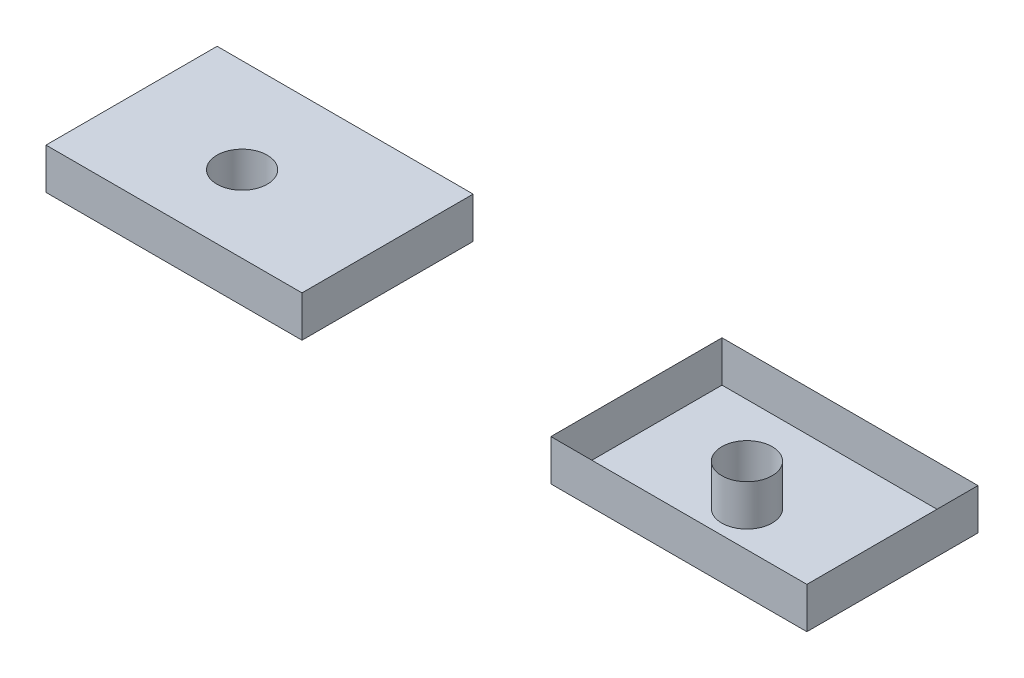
ISO-10303-21;
HEADER;
FILE_DESCRIPTION(('STEP AP214'),'2;1');
FILE_NAME('part.step','',(''),(''),'','','');
FILE_SCHEMA(('AUTOMOTIVE_DESIGN { 1 0 10303 214 1 1 1 1 }'));
ENDSEC;
DATA;
#1=APPLICATION_CONTEXT('core data for automotive mechanical design processes');
#2=APPLICATION_PROTOCOL_DEFINITION('international standard','automotive_design',2000,#1);
#3=PRODUCT_CONTEXT('',#1,'mechanical');
#4=PRODUCT('Part','Part','',(#3));
#5=PRODUCT_RELATED_PRODUCT_CATEGORY('part','',(#4));
#6=PRODUCT_DEFINITION_FORMATION('','',#4);
#7=PRODUCT_DEFINITION_CONTEXT('part definition',#1,'design');
#8=PRODUCT_DEFINITION('design','',#6,#7);
#9=PRODUCT_DEFINITION_SHAPE('','',#8);
#10=(LENGTH_UNIT() NAMED_UNIT(*) SI_UNIT(.MILLI.,.METRE.));
#11=(NAMED_UNIT(*) PLANE_ANGLE_UNIT() SI_UNIT($,.RADIAN.));
#12=(NAMED_UNIT(*) SI_UNIT($,.STERADIAN.) SOLID_ANGLE_UNIT());
#13=UNCERTAINTY_MEASURE_WITH_UNIT(LENGTH_MEASURE(1.E-05),#10,'distance_accuracy_value','');
#14=(GEOMETRIC_REPRESENTATION_CONTEXT(3) GLOBAL_UNCERTAINTY_ASSIGNED_CONTEXT((#13)) GLOBAL_UNIT_ASSIGNED_CONTEXT((#10,
#11,#12)) REPRESENTATION_CONTEXT('',''));
#15=CARTESIAN_POINT('',(0.,0.,0.));
#16=DIRECTION('',(0.,0.,1.));
#17=DIRECTION('',(1.,0.,0.));
#18=AXIS2_PLACEMENT_3D('',#15,#16,#17);
#19=CARTESIAN_POINT('',(490.265330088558,0.,-38.835495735));
#20=DIRECTION('',(0.,1.,0.));
#21=DIRECTION('',(0.,0.,1.));
#22=AXIS2_PLACEMENT_3D('',#19,#20,#21);
#23=CYLINDRICAL_SURFACE('',#22,12.7580583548);
#24=CARTESIAN_POINT('',(490.265330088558,20.7672057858,-38.835495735));
#25=DIRECTION('',(0.,1.,0.));
#26=DIRECTION('',(0.,0.,1.));
#27=AXIS2_PLACEMENT_3D('',#24,#25,#26);
#28=CIRCLE('',#27,12.7580583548);
#29=CARTESIAN_POINT('',(490.265330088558,20.7672057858,-26.0774373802));
#30=VERTEX_POINT('',#29);
#31=EDGE_CURVE('E12',#30,#30,#28,.T.);
#32=ORIENTED_EDGE('',*,*,#31,.F.);
#33=EDGE_LOOP('',(#32));
#34=FACE_BOUND('',#33,.T.);
#35=CARTESIAN_POINT('',(490.265330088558,0.,-38.835495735));
#36=DIRECTION('',(0.,1.,0.));
#37=DIRECTION('',(0.,0.,1.));
#38=AXIS2_PLACEMENT_3D('',#35,#36,#37);
#39=CIRCLE('',#38,12.7580583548);
#40=CARTESIAN_POINT('',(490.265330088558,0.,-26.0774373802));
#41=VERTEX_POINT('',#40);
#42=EDGE_CURVE('E51',#41,#41,#39,.F.);
#43=ORIENTED_EDGE('',*,*,#42,.F.);
#44=EDGE_LOOP('',(#43));
#45=FACE_BOUND('',#44,.T.);
#46=ADVANCED_FACE('F48',(#34,#45),#23,.T.);
#47=CARTESIAN_POINT('',(429.841584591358,0.,0.));
#48=DIRECTION('',(0.,-1.,0.));
#49=DIRECTION('',(0.,0.,-1.));
#50=AXIS2_PLACEMENT_3D('',#47,#48,#49);
#51=PLANE('',#50);
#52=ORIENTED_EDGE('',*,*,#42,.T.);
#53=EDGE_LOOP('',(#52));
#54=FACE_BOUND('',#53,.T.);
#55=DIRECTION('',(0.,0.,1.));
#56=VECTOR('',#55,1.);
#57=CARTESIAN_POINT('',(559.431427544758,0.,-43.3127745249));
#58=LINE('',#57,#56);
#59=CARTESIAN_POINT('',(559.431427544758,0.,-86.6255490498));
#60=VERTEX_POINT('',#59);
#61=CARTESIAN_POINT('',(559.431427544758,0.,0.));
#62=VERTEX_POINT('',#61);
#63=EDGE_CURVE('E64',#60,#62,#58,.T.);
#64=ORIENTED_EDGE('',*,*,#63,.F.);
#65=DIRECTION('',(1.,0.,0.));
#66=VECTOR('',#65,1.);
#67=CARTESIAN_POINT('',(494.636506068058,0.,-86.6255490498));
#68=LINE('',#67,#66);
#69=CARTESIAN_POINT('',(429.841584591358,0.,-86.6255490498));
#70=VERTEX_POINT('',#69);
#71=EDGE_CURVE('E123',#70,#60,#68,.T.);
#72=ORIENTED_EDGE('',*,*,#71,.F.);
#73=DIRECTION('',(0.,0.,-1.));
#74=VECTOR('',#73,1.);
#75=CARTESIAN_POINT('',(429.841584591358,0.,-43.3127745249));
#76=LINE('',#75,#74);
#77=CARTESIAN_POINT('',(429.841584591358,0.,0.));
#78=VERTEX_POINT('',#77);
#79=EDGE_CURVE('E94',#78,#70,#76,.T.);
#80=ORIENTED_EDGE('',*,*,#79,.F.);
#81=DIRECTION('',(-1.,0.,0.));
#82=VECTOR('',#81,1.);
#83=CARTESIAN_POINT('',(494.636506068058,0.,0.));
#84=LINE('',#83,#82);
#85=EDGE_CURVE('E120',#62,#78,#84,.T.);
#86=ORIENTED_EDGE('',*,*,#85,.F.);
#87=EDGE_LOOP('',(#64,#72,#80,#86));
#88=FACE_BOUND('',#87,.T.);
#89=ADVANCED_FACE('F128',(#54,#88),#51,.F.);
#90=CARTESIAN_POINT('',(559.431427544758,0.,0.));
#91=DIRECTION('',(0.,0.,-1.));
#92=DIRECTION('',(-1.,0.,0.));
#93=AXIS2_PLACEMENT_3D('',#90,#91,#92);
#94=PLANE('',#93);
#95=DIRECTION('',(0.,-1.,0.));
#96=VECTOR('',#95,1.);
#97=CARTESIAN_POINT('',(559.431427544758,10.3836028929,0.));
#98=LINE('',#97,#96);
#99=CARTESIAN_POINT('',(559.431427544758,20.7672057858,0.));
#100=VERTEX_POINT('',#99);
#101=EDGE_CURVE('E81',#100,#62,#98,.T.);
#102=ORIENTED_EDGE('',*,*,#101,.T.);
#103=ORIENTED_EDGE('',*,*,#85,.T.);
#104=DIRECTION('',(0.,1.,0.));
#105=VECTOR('',#104,1.);
#106=CARTESIAN_POINT('',(429.841584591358,10.3836028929,0.));
#107=LINE('',#106,#105);
#108=CARTESIAN_POINT('',(429.841584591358,20.7672057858,0.));
#109=VERTEX_POINT('',#108);
#110=EDGE_CURVE('E78',#78,#109,#107,.T.);
#111=ORIENTED_EDGE('',*,*,#110,.T.);
#112=DIRECTION('',(1.,0.,0.));
#113=VECTOR('',#112,1.);
#114=CARTESIAN_POINT('',(494.636506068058,20.7672057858,0.));
#115=LINE('',#114,#113);
#116=EDGE_CURVE('E115',#109,#100,#115,.T.);
#117=ORIENTED_EDGE('',*,*,#116,.T.);
#118=EDGE_LOOP('',(#102,#103,#111,#117));
#119=FACE_BOUND('',#118,.T.);
#120=ADVANCED_FACE('F130',(#119),#94,.T.);
#121=CARTESIAN_POINT('',(559.431427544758,0.,-86.6255490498));
#122=DIRECTION('',(-1.,0.,0.));
#123=DIRECTION('',(0.,0.,1.));
#124=AXIS2_PLACEMENT_3D('',#121,#122,#123);
#125=PLANE('',#124);
#126=DIRECTION('',(0.,-1.,0.));
#127=VECTOR('',#126,1.);
#128=CARTESIAN_POINT('',(559.431427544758,10.3836028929,-86.6255490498));
#129=LINE('',#128,#127);
#130=CARTESIAN_POINT('',(559.431427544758,20.7672057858,-86.6255490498));
#131=VERTEX_POINT('',#130);
#132=EDGE_CURVE('E105',#131,#60,#129,.T.);
#133=ORIENTED_EDGE('',*,*,#132,.T.);
#134=ORIENTED_EDGE('',*,*,#63,.T.);
#135=ORIENTED_EDGE('',*,*,#101,.F.);
#136=DIRECTION('',(0.,0.,-1.));
#137=VECTOR('',#136,1.);
#138=CARTESIAN_POINT('',(559.431427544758,20.7672057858,-43.3127745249));
#139=LINE('',#138,#137);
#140=EDGE_CURVE('E98',#100,#131,#139,.T.);
#141=ORIENTED_EDGE('',*,*,#140,.T.);
#142=EDGE_LOOP('',(#133,#134,#135,#141));
#143=FACE_BOUND('',#142,.T.);
#144=ADVANCED_FACE('F126',(#143),#125,.T.);
#145=CARTESIAN_POINT('',(429.841584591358,0.,-86.6255490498));
#146=DIRECTION('',(0.,0.,1.));
#147=DIRECTION('',(1.,0.,0.));
#148=AXIS2_PLACEMENT_3D('',#145,#146,#147);
#149=PLANE('',#148);
#150=DIRECTION('',(0.,-1.,0.));
#151=VECTOR('',#150,1.);
#152=CARTESIAN_POINT('',(429.841584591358,10.3836028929,-86.6255490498));
#153=LINE('',#152,#151);
#154=CARTESIAN_POINT('',(429.841584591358,20.7672057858,-86.6255490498));
#155=VERTEX_POINT('',#154);
#156=EDGE_CURVE('E90',#155,#70,#153,.T.);
#157=ORIENTED_EDGE('',*,*,#156,.T.);
#158=ORIENTED_EDGE('',*,*,#71,.T.);
#159=ORIENTED_EDGE('',*,*,#132,.F.);
#160=DIRECTION('',(-1.,0.,0.));
#161=VECTOR('',#160,1.);
#162=CARTESIAN_POINT('',(494.636506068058,20.7672057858,-86.6255490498));
#163=LINE('',#162,#161);
#164=EDGE_CURVE('E99',#131,#155,#163,.T.);
#165=ORIENTED_EDGE('',*,*,#164,.T.);
#166=EDGE_LOOP('',(#157,#158,#159,#165));
#167=FACE_BOUND('',#166,.T.);
#168=ADVANCED_FACE('F104',(#167),#149,.T.);
#169=CARTESIAN_POINT('',(429.841584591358,0.,0.));
#170=DIRECTION('',(1.,0.,0.));
#171=DIRECTION('',(0.,0.,-1.));
#172=AXIS2_PLACEMENT_3D('',#169,#170,#171);
#173=PLANE('',#172);
#174=ORIENTED_EDGE('',*,*,#110,.F.);
#175=ORIENTED_EDGE('',*,*,#79,.T.);
#176=ORIENTED_EDGE('',*,*,#156,.F.);
#177=DIRECTION('',(0.,0.,1.));
#178=VECTOR('',#177,1.);
#179=CARTESIAN_POINT('',(429.841584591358,20.7672057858,-43.3127745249));
#180=LINE('',#179,#178);
#181=EDGE_CURVE('E92',#155,#109,#180,.T.);
#182=ORIENTED_EDGE('',*,*,#181,.T.);
#183=EDGE_LOOP('',(#174,#175,#176,#182));
#184=FACE_BOUND('',#183,.T.);
#185=ADVANCED_FACE('F49',(#184),#173,.T.);
#186=OPEN_SHELL('',(#46,#89,#120,#144,#168,#185));
#187=SHELL_BASED_SURFACE_MODEL('B2',(#186));
#188=CARTESIAN_POINT('',(174.275363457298,20.7672057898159,0.));
#189=DIRECTION('',(1.,0.,0.));
#190=DIRECTION('',(0.,0.,-1.));
#191=AXIS2_PLACEMENT_3D('',#188,#189,#190);
#192=PLANE('',#191);
#193=DIRECTION('',(0.,0.,1.));
#194=VECTOR('',#193,1.);
#195=CARTESIAN_POINT('',(174.275363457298,0.,0.));
#196=LINE('',#195,#194);
#197=CARTESIAN_POINT('',(174.275363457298,0.,-86.6255490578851));
#198=VERTEX_POINT('',#197);
#199=CARTESIAN_POINT('',(174.275363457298,0.,0.));
#200=VERTEX_POINT('',#199);
#201=EDGE_CURVE('E263',#198,#200,#196,.T.);
#202=ORIENTED_EDGE('',*,*,#201,.T.);
#203=DIRECTION('',(0.,-1.,0.));
#204=VECTOR('',#203,1.);
#205=CARTESIAN_POINT('',(174.275363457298,20.7672057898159,0.));
#206=LINE('',#205,#204);
#207=CARTESIAN_POINT('',(174.275363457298,20.7672057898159,0.));
#208=VERTEX_POINT('',#207);
#209=EDGE_CURVE('E46',#208,#200,#206,.T.);
#210=ORIENTED_EDGE('',*,*,#209,.F.);
#211=DIRECTION('',(0.,0.,1.));
#212=VECTOR('',#211,1.);
#213=CARTESIAN_POINT('',(174.275363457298,20.7672057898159,0.));
#214=LINE('',#213,#212);
#215=CARTESIAN_POINT('',(174.275363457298,20.7672057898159,-86.6255490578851));
#216=VERTEX_POINT('',#215);
#217=EDGE_CURVE('E286',#216,#208,#214,.T.);
#218=ORIENTED_EDGE('',*,*,#217,.F.);
#219=DIRECTION('',(0.,-1.,0.));
#220=VECTOR('',#219,1.);
#221=CARTESIAN_POINT('',(174.275363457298,20.7672057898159,-86.6255490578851));
#222=LINE('',#221,#220);
#223=EDGE_CURVE('E275',#216,#198,#222,.T.);
#224=ORIENTED_EDGE('',*,*,#223,.T.);
#225=EDGE_LOOP('',(#202,#210,#218,#224));
#226=FACE_BOUND('',#225,.T.);
#227=ADVANCED_FACE('F219',(#226),#192,.F.);
#228=CARTESIAN_POINT('',(174.275363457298,20.7672057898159,0.));
#229=DIRECTION('',(0.,0.,-1.));
#230=DIRECTION('',(-1.,0.,0.));
#231=AXIS2_PLACEMENT_3D('',#228,#229,#230);
#232=PLANE('',#231);
#233=DIRECTION('',(1.,0.,0.));
#234=VECTOR('',#233,1.);
#235=CARTESIAN_POINT('',(174.275363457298,0.,0.));
#236=LINE('',#235,#234);
#237=CARTESIAN_POINT('',(303.86520640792,0.,0.));
#238=VERTEX_POINT('',#237);
#239=EDGE_CURVE('E259',#200,#238,#236,.T.);
#240=ORIENTED_EDGE('',*,*,#239,.T.);
#241=DIRECTION('',(0.,-1.,0.));
#242=VECTOR('',#241,1.);
#243=CARTESIAN_POINT('',(303.86520640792,20.7672057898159,0.));
#244=LINE('',#243,#242);
#245=CARTESIAN_POINT('',(303.86520640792,20.7672057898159,0.));
#246=VERTEX_POINT('',#245);
#247=EDGE_CURVE('E226',#246,#238,#244,.T.);
#248=ORIENTED_EDGE('',*,*,#247,.F.);
#249=DIRECTION('',(1.,0.,0.));
#250=VECTOR('',#249,1.);
#251=CARTESIAN_POINT('',(174.275363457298,20.7672057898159,0.));
#252=LINE('',#251,#250);
#253=EDGE_CURVE('E271',#208,#246,#252,.T.);
#254=ORIENTED_EDGE('',*,*,#253,.F.);
#255=ORIENTED_EDGE('',*,*,#209,.T.);
#256=EDGE_LOOP('',(#240,#248,#254,#255));
#257=FACE_BOUND('',#256,.T.);
#258=ADVANCED_FACE('F270',(#257),#232,.F.);
#259=CARTESIAN_POINT('',(303.86520640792,20.7672057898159,0.));
#260=DIRECTION('',(-1.,0.,0.));
#261=DIRECTION('',(0.,0.,1.));
#262=AXIS2_PLACEMENT_3D('',#259,#260,#261);
#263=PLANE('',#262);
#264=DIRECTION('',(0.,0.,-1.));
#265=VECTOR('',#264,1.);
#266=CARTESIAN_POINT('',(303.86520640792,0.,0.));
#267=LINE('',#266,#265);
#268=CARTESIAN_POINT('',(303.86520640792,0.,-86.6255490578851));
#269=VERTEX_POINT('',#268);
#270=EDGE_CURVE('E264',#238,#269,#267,.T.);
#271=ORIENTED_EDGE('',*,*,#270,.T.);
#272=DIRECTION('',(0.,-1.,0.));
#273=VECTOR('',#272,1.);
#274=CARTESIAN_POINT('',(303.86520640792,20.7672057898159,-86.6255490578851));
#275=LINE('',#274,#273);
#276=CARTESIAN_POINT('',(303.86520640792,20.7672057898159,-86.6255490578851));
#277=VERTEX_POINT('',#276);
#278=EDGE_CURVE('E292',#277,#269,#275,.T.);
#279=ORIENTED_EDGE('',*,*,#278,.F.);
#280=DIRECTION('',(0.,0.,-1.));
#281=VECTOR('',#280,1.);
#282=CARTESIAN_POINT('',(303.86520640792,20.7672057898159,0.));
#283=LINE('',#282,#281);
#284=EDGE_CURVE('E238',#246,#277,#283,.T.);
#285=ORIENTED_EDGE('',*,*,#284,.F.);
#286=ORIENTED_EDGE('',*,*,#247,.T.);
#287=EDGE_LOOP('',(#271,#279,#285,#286));
#288=FACE_BOUND('',#287,.T.);
#289=ADVANCED_FACE('F295',(#288),#263,.F.);
#290=CARTESIAN_POINT('',(174.275363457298,20.7672057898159,-86.6255490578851));
#291=DIRECTION('',(0.,0.,1.));
#292=DIRECTION('',(1.,0.,0.));
#293=AXIS2_PLACEMENT_3D('',#290,#291,#292);
#294=PLANE('',#293);
#295=DIRECTION('',(-1.,0.,0.));
#296=VECTOR('',#295,1.);
#297=CARTESIAN_POINT('',(174.275363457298,0.,-86.6255490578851));
#298=LINE('',#297,#296);
#299=EDGE_CURVE('E284',#269,#198,#298,.T.);
#300=ORIENTED_EDGE('',*,*,#299,.T.);
#301=ORIENTED_EDGE('',*,*,#223,.F.);
#302=DIRECTION('',(-1.,0.,0.));
#303=VECTOR('',#302,1.);
#304=CARTESIAN_POINT('',(174.275363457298,20.7672057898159,-86.6255490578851));
#305=LINE('',#304,#303);
#306=EDGE_CURVE('E233',#277,#216,#305,.T.);
#307=ORIENTED_EDGE('',*,*,#306,.F.);
#308=ORIENTED_EDGE('',*,*,#278,.T.);
#309=EDGE_LOOP('',(#300,#301,#307,#308));
#310=FACE_BOUND('',#309,.T.);
#311=ADVANCED_FACE('F297',(#310),#294,.F.);
#312=CARTESIAN_POINT('',(174.275363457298,20.7672057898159,-86.6255490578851));
#313=DIRECTION('',(0.,-1.,0.));
#314=DIRECTION('',(0.,0.,-1.));
#315=AXIS2_PLACEMENT_3D('',#312,#313,#314);
#316=PLANE('',#315);
#317=CARTESIAN_POINT('',(234.699108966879,20.7672057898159,-38.8354957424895));
#318=DIRECTION('',(0.,1.,0.));
#319=DIRECTION('',(0.,0.,1.));
#320=AXIS2_PLACEMENT_3D('',#317,#318,#319);
#321=CIRCLE('',#320,12.7580583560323);
#322=CARTESIAN_POINT('',(234.699108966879,20.7672057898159,-26.0774373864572));
#323=VERTEX_POINT('',#322);
#324=EDGE_CURVE('E279',#323,#323,#321,.T.);
#325=ORIENTED_EDGE('',*,*,#324,.F.);
#326=EDGE_LOOP('',(#325));
#327=FACE_BOUND('',#326,.T.);
#328=ORIENTED_EDGE('',*,*,#217,.T.);
#329=ORIENTED_EDGE('',*,*,#253,.T.);
#330=ORIENTED_EDGE('',*,*,#284,.T.);
#331=ORIENTED_EDGE('',*,*,#306,.T.);
#332=EDGE_LOOP('',(#328,#329,#330,#331));
#333=FACE_BOUND('',#332,.T.);
#334=ADVANCED_FACE('F298',(#327,#333),#316,.F.);
#335=CARTESIAN_POINT('',(174.275363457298,0.,-86.6255490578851));
#336=DIRECTION('',(0.,-1.,0.));
#337=DIRECTION('',(0.,0.,-1.));
#338=AXIS2_PLACEMENT_3D('',#335,#336,#337);
#339=PLANE('',#338);
#340=CARTESIAN_POINT('',(234.699108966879,0.,-38.8354957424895));
#341=DIRECTION('',(0.,1.,0.));
#342=DIRECTION('',(0.,0.,1.));
#343=AXIS2_PLACEMENT_3D('',#340,#341,#342);
#344=CIRCLE('',#343,12.7580583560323);
#345=CARTESIAN_POINT('',(234.699108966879,0.,-26.0774373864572));
#346=VERTEX_POINT('',#345);
#347=EDGE_CURVE('E276',#346,#346,#344,.T.);
#348=ORIENTED_EDGE('',*,*,#347,.T.);
#349=EDGE_LOOP('',(#348));
#350=FACE_BOUND('',#349,.T.);
#351=ORIENTED_EDGE('',*,*,#201,.F.);
#352=ORIENTED_EDGE('',*,*,#299,.F.);
#353=ORIENTED_EDGE('',*,*,#270,.F.);
#354=ORIENTED_EDGE('',*,*,#239,.F.);
#355=EDGE_LOOP('',(#351,#352,#353,#354));
#356=FACE_BOUND('',#355,.T.);
#357=ADVANCED_FACE('F260',(#350,#356),#339,.T.);
#358=CARTESIAN_POINT('',(234.699108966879,0.,-38.8354957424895));
#359=DIRECTION('',(0.,1.,0.));
#360=DIRECTION('',(0.,0.,1.));
#361=AXIS2_PLACEMENT_3D('',#358,#359,#360);
#362=CYLINDRICAL_SURFACE('',#361,12.7580583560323);
#363=CARTESIAN_POINT('',(234.699108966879,0.,-26.0774373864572));
#364=CARTESIAN_POINT('',(234.699108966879,0.216325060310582,-26.0774373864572));
#365=CARTESIAN_POINT('',(234.699108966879,0.432650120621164,-26.0774373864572));
#366=CARTESIAN_POINT('',(234.699108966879,0.865300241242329,-26.0774373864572));
#367=CARTESIAN_POINT('',(234.699108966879,1.08162530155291,-26.0774373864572));
#368=CARTESIAN_POINT('',(234.699108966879,1.51427542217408,-26.0774373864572));
#369=CARTESIAN_POINT('',(234.699108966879,1.73060048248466,-26.0774373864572));
#370=CARTESIAN_POINT('',(234.699108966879,2.16325060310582,-26.0774373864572));
#371=CARTESIAN_POINT('',(234.699108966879,2.3795756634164,-26.0774373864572));
#372=CARTESIAN_POINT('',(234.699108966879,2.81222578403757,-26.0774373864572));
#373=CARTESIAN_POINT('',(234.699108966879,3.02855084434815,-26.0774373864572));
#374=CARTESIAN_POINT('',(234.699108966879,3.46120096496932,-26.0774373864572));
#375=CARTESIAN_POINT('',(234.699108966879,3.6775260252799,-26.0774373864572));
#376=CARTESIAN_POINT('',(234.699108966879,4.11017614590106,-26.0774373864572));
#377=CARTESIAN_POINT('',(234.699108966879,4.32650120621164,-26.0774373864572));
#378=CARTESIAN_POINT('',(234.699108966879,4.75915132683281,-26.0774373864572));
#379=CARTESIAN_POINT('',(234.699108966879,4.97547638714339,-26.0774373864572));
#380=CARTESIAN_POINT('',(234.699108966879,5.40812650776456,-26.0774373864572));
#381=CARTESIAN_POINT('',(234.699108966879,5.62445156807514,-26.0774373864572));
#382=CARTESIAN_POINT('',(234.699108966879,6.0571016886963,-26.0774373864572));
#383=CARTESIAN_POINT('',(234.699108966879,6.27342674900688,-26.0774373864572));
#384=CARTESIAN_POINT('',(234.699108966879,6.70607686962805,-26.0774373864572));
#385=CARTESIAN_POINT('',(234.699108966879,6.92240192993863,-26.0774373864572));
#386=CARTESIAN_POINT('',(234.699108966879,7.3550520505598,-26.0774373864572));
#387=CARTESIAN_POINT('',(234.699108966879,7.57137711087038,-26.0774373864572));
#388=CARTESIAN_POINT('',(234.699108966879,8.00402723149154,-26.0774373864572));
#389=CARTESIAN_POINT('',(234.699108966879,8.22035229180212,-26.0774373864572));
#390=CARTESIAN_POINT('',(234.699108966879,8.65300241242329,-26.0774373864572));
#391=CARTESIAN_POINT('',(234.699108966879,8.86932747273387,-26.0774373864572));
#392=CARTESIAN_POINT('',(234.699108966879,9.30197759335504,-26.0774373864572));
#393=CARTESIAN_POINT('',(234.699108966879,9.51830265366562,-26.0774373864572));
#394=CARTESIAN_POINT('',(234.699108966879,9.95095277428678,-26.0774373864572));
#395=CARTESIAN_POINT('',(234.699108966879,10.1672778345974,-26.0774373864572));
#396=CARTESIAN_POINT('',(234.699108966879,10.5999279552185,-26.0774373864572));
#397=CARTESIAN_POINT('',(234.699108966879,10.8162530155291,-26.0774373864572));
#398=CARTESIAN_POINT('',(234.699108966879,11.2489031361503,-26.0774373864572));
#399=CARTESIAN_POINT('',(234.699108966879,11.4652281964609,-26.0774373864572));
#400=CARTESIAN_POINT('',(234.699108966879,11.897878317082,-26.0774373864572));
#401=CARTESIAN_POINT('',(234.699108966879,12.1142033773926,-26.0774373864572));
#402=CARTESIAN_POINT('',(234.699108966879,12.5468534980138,-26.0774373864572));
#403=CARTESIAN_POINT('',(234.699108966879,12.7631785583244,-26.0774373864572));
#404=CARTESIAN_POINT('',(234.699108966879,13.1958286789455,-26.0774373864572));
#405=CARTESIAN_POINT('',(234.699108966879,13.4121537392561,-26.0774373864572));
#406=CARTESIAN_POINT('',(234.699108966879,13.8448038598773,-26.0774373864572));
#407=CARTESIAN_POINT('',(234.699108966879,14.0611289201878,-26.0774373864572));
#408=CARTESIAN_POINT('',(234.699108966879,14.493779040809,-26.0774373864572));
#409=CARTESIAN_POINT('',(234.699108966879,14.7101041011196,-26.0774373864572));
#410=CARTESIAN_POINT('',(234.699108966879,15.1427542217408,-26.0774373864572));
#411=CARTESIAN_POINT('',(234.699108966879,15.3590792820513,-26.0774373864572));
#412=CARTESIAN_POINT('',(234.699108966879,15.7917294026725,-26.0774373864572));
#413=CARTESIAN_POINT('',(234.699108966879,16.0080544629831,-26.0774373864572));
#414=CARTESIAN_POINT('',(234.699108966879,16.4407045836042,-26.0774373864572));
#415=CARTESIAN_POINT('',(234.699108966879,16.6570296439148,-26.0774373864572));
#416=CARTESIAN_POINT('',(234.699108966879,17.089679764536,-26.0774373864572));
#417=CARTESIAN_POINT('',(234.699108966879,17.3060048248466,-26.0774373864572));
#418=CARTESIAN_POINT('',(234.699108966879,17.7386549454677,-26.0774373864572));
#419=CARTESIAN_POINT('',(234.699108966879,17.9549800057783,-26.0774373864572));
#420=CARTESIAN_POINT('',(234.699108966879,18.3876301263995,-26.0774373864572));
#421=CARTESIAN_POINT('',(234.699108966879,18.6039551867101,-26.0774373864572));
#422=CARTESIAN_POINT('',(234.699108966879,19.0366053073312,-26.0774373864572));
#423=CARTESIAN_POINT('',(234.699108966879,19.2529303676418,-26.0774373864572));
#424=CARTESIAN_POINT('',(234.699108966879,19.685580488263,-26.0774373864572));
#425=CARTESIAN_POINT('',(234.699108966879,19.9019055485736,-26.0774373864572));
#426=CARTESIAN_POINT('',(234.699108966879,20.3345556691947,-26.0774373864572));
#427=CARTESIAN_POINT('',(234.699108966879,20.5508807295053,-26.0774373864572));
#428=CARTESIAN_POINT('',(234.699108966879,20.7672057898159,-26.0774373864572));
#429=B_SPLINE_CURVE_WITH_KNOTS('',3,(#363,#364,#365,#366,#367,#368,#369,#370,#371,#372,#373,
#374,#375,#376,#377,#378,#379,#380,#381,#382,#383,#384,#385,#386,#387,#388,#389,#390,#391,#392,
#393,#394,#395,#396,#397,#398,#399,#400,#401,#402,#403,#404,#405,#406,#407,#408,#409,#410,#411,
#412,#413,#414,#415,#416,#417,#418,#419,#420,#421,#422,#423,#424,#425,#426,#427,#428),
.UNSPECIFIED.,.F.,.F.,(4,2,2,2,2,2,2,2,2,2,2,2,2,2,2,2,2,2,2,2,2,2,2,2,2,2,2,2,2,2,2,2,4),(0.,
0.648975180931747,1.29795036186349,1.94692554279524,2.59590072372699,3.24487590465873,
3.89385108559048,4.54282626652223,5.19180144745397,5.84077662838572,6.48975180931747,
7.13872699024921,7.78770217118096,8.43667735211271,9.08565253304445,9.7346277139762,
10.3836028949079,11.0325780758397,11.6815532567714,12.3305284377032,12.9795036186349,
13.6284787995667,14.2774539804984,14.9264291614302,15.5754043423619,16.2243795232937,
16.8733547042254,17.5223298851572,18.1713050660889,18.8202802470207,19.4692554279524,
20.1182306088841,20.7672057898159),.UNSPECIFIED.);
#430=EDGE_CURVE('BSEAM306',#346,#323,#429,.T.);
#431=ORIENTED_EDGE('',*,*,#347,.F.);
#432=ORIENTED_EDGE('',*,*,#324,.T.);
#433=ORIENTED_EDGE('',*,*,#430,.T.);
#434=ORIENTED_EDGE('',*,*,#430,.F.);
#435=EDGE_LOOP('',(#431,#433,#432,#434));
#436=FACE_BOUND('',#435,.T.);
#437=ADVANCED_FACE('F306',(#436),#362,.F.);
#438=CLOSED_SHELL('',(#227,#258,#289,#311,#334,#357,#437));
#439=MANIFOLD_SOLID_BREP('B6',#438);
#440=ADVANCED_BREP_SHAPE_REPRESENTATION('',(#18,#439),#14);
#441=MANIFOLD_SURFACE_SHAPE_REPRESENTATION('',(#18,#187),#14);
#442=SHAPE_REPRESENTATION('',(#18),#14);
#443=SHAPE_DEFINITION_REPRESENTATION(#9,#442);
#444=SHAPE_REPRESENTATION_RELATIONSHIP('','',#442,#440);
#445=SHAPE_REPRESENTATION_RELATIONSHIP('','',#442,#441);
ENDSEC;
END-ISO-10303-21;
